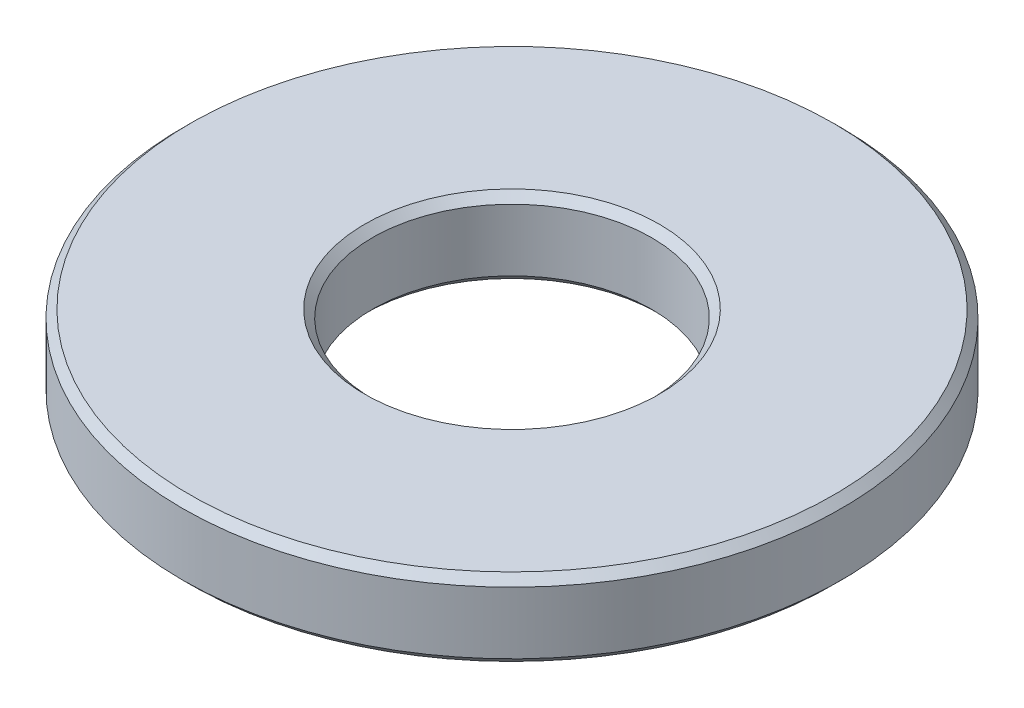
from build123d import *


with BuildPart() as part:
    # Esquisse1 → R_volution1 (revolve)
    with BuildSketch(Plane.XY, mode=Mode.PRIVATE) as r_volution1_sk:
        Polygon((36, 2), (36, 18), (38, 20), (83, 20), (85, 18), (85, 2), (83, 0), (38, 0), align=None)
    revolve(r_volution1_sk.sketch.rotate(Axis((0, 0, 0), (0, 1, 0)), 90), axis=Axis((0, 0, 0), (0, 1, 0)))


solid = part.part
